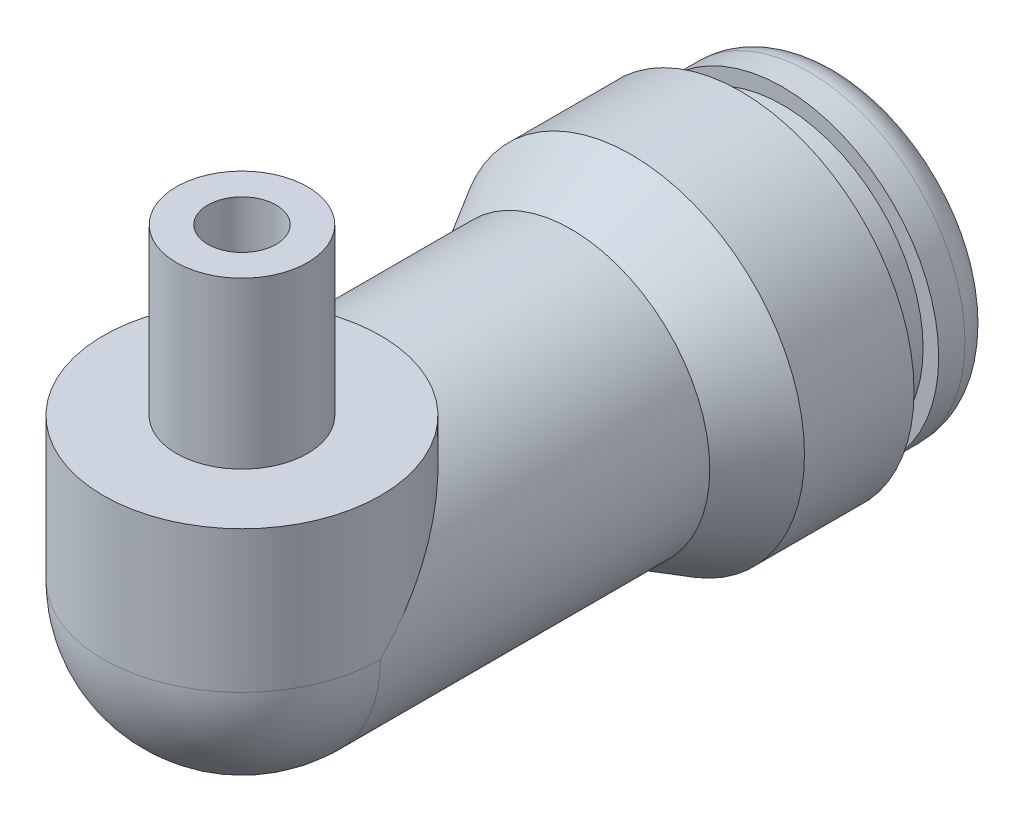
ISO-10303-21;
HEADER;
FILE_DESCRIPTION(('STEP AP214'),'2;1');
FILE_NAME('part.step','',(''),(''),'','','');
FILE_SCHEMA(('AUTOMOTIVE_DESIGN { 1 0 10303 214 1 1 1 1 }'));
ENDSEC;
DATA;
#1=APPLICATION_CONTEXT('core data for automotive mechanical design processes');
#2=APPLICATION_PROTOCOL_DEFINITION('international standard','automotive_design',2000,#1);
#3=PRODUCT_CONTEXT('',#1,'mechanical');
#4=PRODUCT('Part','Part','',(#3));
#5=PRODUCT_RELATED_PRODUCT_CATEGORY('part','',(#4));
#6=PRODUCT_DEFINITION_FORMATION('','',#4);
#7=PRODUCT_DEFINITION_CONTEXT('part definition',#1,'design');
#8=PRODUCT_DEFINITION('design','',#6,#7);
#9=PRODUCT_DEFINITION_SHAPE('','',#8);
#10=(LENGTH_UNIT() NAMED_UNIT(*) SI_UNIT(.MILLI.,.METRE.));
#11=(NAMED_UNIT(*) PLANE_ANGLE_UNIT() SI_UNIT($,.RADIAN.));
#12=(NAMED_UNIT(*) SI_UNIT($,.STERADIAN.) SOLID_ANGLE_UNIT());
#13=UNCERTAINTY_MEASURE_WITH_UNIT(LENGTH_MEASURE(1.E-05),#10,'distance_accuracy_value','');
#14=(GEOMETRIC_REPRESENTATION_CONTEXT(3) GLOBAL_UNCERTAINTY_ASSIGNED_CONTEXT((#13)) GLOBAL_UNIT_ASSIGNED_CONTEXT((#10,
#11,#12)) REPRESENTATION_CONTEXT('',''));
#15=CARTESIAN_POINT('',(0.,0.,0.));
#16=DIRECTION('',(0.,0.,1.));
#17=DIRECTION('',(1.,0.,0.));
#18=AXIS2_PLACEMENT_3D('',#15,#16,#17);
#19=CARTESIAN_POINT('',(0.,3.429,0.));
#20=DIRECTION('',(0.,-1.,0.));
#21=DIRECTION('',(0.,0.,-1.));
#22=AXIS2_PLACEMENT_3D('',#19,#20,#21);
#23=CYLINDRICAL_SURFACE('',#22,0.8255);
#24=CARTESIAN_POINT('',(0.,0.,0.));
#25=DIRECTION('',(0.,-0.707106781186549,-0.707106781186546));
#26=DIRECTION('',(0.,-0.707106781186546,0.707106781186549));
#27=AXIS2_PLACEMENT_3D('',#24,#25,#26);
#28=ELLIPSE('',#27,1.16743329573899,0.8255);
#29=CARTESIAN_POINT('',(0.8255,0.,0.));
#30=VERTEX_POINT('',#29);
#31=CARTESIAN_POINT('',(-0.8255,0.,0.));
#32=VERTEX_POINT('',#31);
#33=EDGE_CURVE('E63',#30,#32,#28,.F.);
#34=ORIENTED_EDGE('',*,*,#33,.F.);
#35=CARTESIAN_POINT('',(0.,0.,0.));
#36=DIRECTION('',(0.,-1.,0.));
#37=DIRECTION('',(1.,0.,0.));
#38=AXIS2_PLACEMENT_3D('',#35,#36,#37);
#39=CIRCLE('',#38,0.8255);
#40=EDGE_CURVE('E67',#30,#32,#39,.T.);
#41=ORIENTED_EDGE('',*,*,#40,.T.);
#42=EDGE_LOOP('',(#34,#41));
#43=FACE_BOUND('',#42,.T.);
#44=CARTESIAN_POINT('',(0.,7.429,0.));
#45=DIRECTION('',(0.,1.,0.));
#46=DIRECTION('',(0.,0.,1.));
#47=AXIS2_PLACEMENT_3D('',#44,#45,#46);
#48=CIRCLE('',#47,0.8255);
#49=CARTESIAN_POINT('',(0.,7.429,0.825499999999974));
#50=VERTEX_POINT('',#49);
#51=EDGE_CURVE('E355',#50,#50,#48,.F.);
#52=ORIENTED_EDGE('',*,*,#51,.F.);
#53=EDGE_LOOP('',(#52));
#54=FACE_BOUND('',#53,.T.);
#55=ADVANCED_FACE('F35',(#43,#54),#23,.F.);
#56=CARTESIAN_POINT('',(0.,23.6671280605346,0.));
#57=DIRECTION('',(0.,-1.,0.));
#58=DIRECTION('',(0.,0.,-1.));
#59=AXIS2_PLACEMENT_3D('',#56,#57,#58);
#60=CYLINDRICAL_SURFACE('',#59,1.5875);
#61=CARTESIAN_POINT('',(0.,3.429,0.));
#62=DIRECTION('',(0.,1.,0.));
#63=DIRECTION('',(0.,0.,1.));
#64=AXIS2_PLACEMENT_3D('',#61,#62,#63);
#65=CIRCLE('',#64,1.5875);
#66=CARTESIAN_POINT('',(0.,3.42900000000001,1.58749999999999));
#67=VERTEX_POINT('',#66);
#68=EDGE_CURVE('E70',#67,#67,#65,.T.);
#69=ORIENTED_EDGE('',*,*,#68,.T.);
#70=EDGE_LOOP('',(#69));
#71=FACE_BOUND('',#70,.T.);
#72=CARTESIAN_POINT('',(0.,7.429,0.));
#73=DIRECTION('',(0.,1.,0.));
#74=DIRECTION('',(0.,0.,1.));
#75=AXIS2_PLACEMENT_3D('',#72,#73,#74);
#76=CIRCLE('',#75,1.5875);
#77=CARTESIAN_POINT('',(0.,7.42900000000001,1.58749999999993));
#78=VERTEX_POINT('',#77);
#79=EDGE_CURVE('E358',#78,#78,#76,.F.);
#80=ORIENTED_EDGE('',*,*,#79,.T.);
#81=EDGE_LOOP('',(#80));
#82=FACE_BOUND('',#81,.T.);
#83=ADVANCED_FACE('F206',(#71,#82),#60,.T.);
#84=CARTESIAN_POINT('',(0.,3.429,0.));
#85=DIRECTION('',(0.,1.,0.));
#86=DIRECTION('',(0.,0.,1.));
#87=AXIS2_PLACEMENT_3D('',#84,#85,#86);
#88=PLANE('',#87);
#89=CARTESIAN_POINT('',(0.,3.429,0.));
#90=DIRECTION('',(0.,1.,0.));
#91=DIRECTION('',(0.,0.,1.));
#92=AXIS2_PLACEMENT_3D('',#89,#90,#91);
#93=CIRCLE('',#92,3.3528);
#94=CARTESIAN_POINT('',(0.,3.42900000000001,3.35279999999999));
#95=VERTEX_POINT('',#94);
#96=EDGE_CURVE('E91',#95,#95,#93,.T.);
#97=ORIENTED_EDGE('',*,*,#96,.T.);
#98=EDGE_LOOP('',(#97));
#99=FACE_BOUND('',#98,.T.);
#100=ORIENTED_EDGE('',*,*,#68,.F.);
#101=EDGE_LOOP('',(#100));
#102=FACE_BOUND('',#101,.T.);
#103=ADVANCED_FACE('F190',(#99,#102),#88,.T.);
#104=CARTESIAN_POINT('',(0.,0.,0.));
#105=DIRECTION('',(0.,0.,1.));
#106=DIRECTION('',(1.,0.,0.));
#107=AXIS2_PLACEMENT_3D('',#104,#105,#106);
#108=CYLINDRICAL_SURFACE('',#107,1.5875);
#109=CARTESIAN_POINT('',(0.,0.,-14.097));
#110=DIRECTION('',(0.,0.,1.));
#111=DIRECTION('',(1.,0.,0.));
#112=AXIS2_PLACEMENT_3D('',#109,#110,#111);
#113=CIRCLE('',#112,1.5875);
#114=CARTESIAN_POINT('',(1.5875,0.,-14.097));
#115=VERTEX_POINT('',#114);
#116=EDGE_CURVE('E82',#115,#115,#113,.T.);
#117=ORIENTED_EDGE('',*,*,#116,.F.);
#118=EDGE_LOOP('',(#117));
#119=FACE_BOUND('',#118,.T.);
#120=CARTESIAN_POINT('',(0.,0.,-3.3528));
#121=DIRECTION('',(0.,0.,1.));
#122=DIRECTION('',(1.,0.,0.));
#123=AXIS2_PLACEMENT_3D('',#120,#121,#122);
#124=CIRCLE('',#123,1.5875);
#125=CARTESIAN_POINT('',(1.5875,0.,-3.3528));
#126=VERTEX_POINT('',#125);
#127=EDGE_CURVE('E13',#126,#126,#124,.F.);
#128=ORIENTED_EDGE('',*,*,#127,.F.);
#129=EDGE_LOOP('',(#128));
#130=FACE_BOUND('',#129,.T.);
#131=ADVANCED_FACE('F37',(#119,#130),#108,.F.);
#132=CARTESIAN_POINT('',(0.,0.,0.));
#133=DIRECTION('',(0.,0.,1.));
#134=DIRECTION('',(1.,0.,0.));
#135=AXIS2_PLACEMENT_3D('',#132,#133,#134);
#136=CYLINDRICAL_SURFACE('',#135,3.3528);
#137=CARTESIAN_POINT('',(0.,0.,0.));
#138=DIRECTION('',(0.,0.,1.));
#139=DIRECTION('',(1.,0.,0.));
#140=AXIS2_PLACEMENT_3D('',#137,#138,#139);
#141=CIRCLE('',#140,3.3528);
#142=CARTESIAN_POINT('',(-3.3528,0.,0.));
#143=VERTEX_POINT('',#142);
#144=CARTESIAN_POINT('',(3.3528,0.,0.));
#145=VERTEX_POINT('',#144);
#146=EDGE_CURVE('E51',#143,#145,#141,.T.);
#147=ORIENTED_EDGE('',*,*,#146,.F.);
#148=CARTESIAN_POINT('',(0.,0.,0.));
#149=DIRECTION('',(0.,0.707106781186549,0.707106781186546));
#150=DIRECTION('',(0.,-0.707106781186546,0.707106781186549));
#151=AXIS2_PLACEMENT_3D('',#148,#149,#150);
#152=ELLIPSE('',#151,4.74157523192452,3.3528);
#153=EDGE_CURVE('E55',#143,#145,#152,.F.);
#154=ORIENTED_EDGE('',*,*,#153,.T.);
#155=EDGE_LOOP('',(#147,#154));
#156=FACE_BOUND('',#155,.T.);
#157=CARTESIAN_POINT('',(0.,0.,-7.9629));
#158=DIRECTION('',(0.,0.,1.));
#159=DIRECTION('',(1.,0.,0.));
#160=AXIS2_PLACEMENT_3D('',#157,#158,#159);
#161=CIRCLE('',#160,3.3528);
#162=CARTESIAN_POINT('',(3.3528,0.,-7.9629));
#163=VERTEX_POINT('',#162);
#164=EDGE_CURVE('E44',#163,#163,#161,.T.);
#165=ORIENTED_EDGE('',*,*,#164,.T.);
#166=EDGE_LOOP('',(#165));
#167=FACE_BOUND('',#166,.T.);
#168=ADVANCED_FACE('F131',(#156,#167),#136,.T.);
#169=CARTESIAN_POINT('',(0.,0.,-9.41470498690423));
#170=DIRECTION('',(0.,0.,-1.));
#171=DIRECTION('',(-1.,0.,0.));
#172=AXIS2_PLACEMENT_3D('',#169,#170,#171);
#173=CONICAL_SURFACE('',#172,4.191,0.5235987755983);
#174=ORIENTED_EDGE('',*,*,#164,.F.);
#175=EDGE_LOOP('',(#174));
#176=FACE_BOUND('',#175,.T.);
#177=CARTESIAN_POINT('',(0.,0.,-9.41470498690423));
#178=DIRECTION('',(0.,0.,1.));
#179=DIRECTION('',(1.,0.,0.));
#180=AXIS2_PLACEMENT_3D('',#177,#178,#179);
#181=CIRCLE('',#180,4.191);
#182=CARTESIAN_POINT('',(4.191,0.,-9.41470498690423));
#183=VERTEX_POINT('',#182);
#184=EDGE_CURVE('E125',#183,#183,#181,.T.);
#185=ORIENTED_EDGE('',*,*,#184,.T.);
#186=EDGE_LOOP('',(#185));
#187=FACE_BOUND('',#186,.T.);
#188=ADVANCED_FACE('F133',(#176,#187),#173,.T.);
#189=CARTESIAN_POINT('',(0.,0.,0.));
#190=DIRECTION('',(0.,0.,1.));
#191=DIRECTION('',(1.,0.,0.));
#192=AXIS2_PLACEMENT_3D('',#189,#190,#191);
#193=CYLINDRICAL_SURFACE('',#192,4.191);
#194=ORIENTED_EDGE('',*,*,#184,.F.);
#195=EDGE_LOOP('',(#194));
#196=FACE_BOUND('',#195,.T.);
#197=CARTESIAN_POINT('',(0.,0.,-12.065));
#198=DIRECTION('',(0.,0.,1.));
#199=DIRECTION('',(1.,0.,0.));
#200=AXIS2_PLACEMENT_3D('',#197,#198,#199);
#201=CIRCLE('',#200,4.191);
#202=CARTESIAN_POINT('',(4.191,0.,-12.065));
#203=VERTEX_POINT('',#202);
#204=EDGE_CURVE('E122',#203,#203,#201,.T.);
#205=ORIENTED_EDGE('',*,*,#204,.T.);
#206=EDGE_LOOP('',(#205));
#207=FACE_BOUND('',#206,.T.);
#208=ADVANCED_FACE('F136',(#196,#207),#193,.T.);
#209=CARTESIAN_POINT('',(0.,4.191,-12.065));
#210=DIRECTION('',(0.,0.,1.));
#211=DIRECTION('',(1.,0.,0.));
#212=AXIS2_PLACEMENT_3D('',#209,#210,#211);
#213=PLANE('',#212);
#214=ORIENTED_EDGE('',*,*,#204,.F.);
#215=EDGE_LOOP('',(#214));
#216=FACE_BOUND('',#215,.T.);
#217=CARTESIAN_POINT('',(0.,0.,-12.065));
#218=DIRECTION('',(0.,0.,1.));
#219=DIRECTION('',(1.,0.,0.));
#220=AXIS2_PLACEMENT_3D('',#217,#218,#219);
#221=CIRCLE('',#220,3.39471);
#222=CARTESIAN_POINT('',(3.39471,0.,-12.065));
#223=VERTEX_POINT('',#222);
#224=EDGE_CURVE('E119',#223,#223,#221,.T.);
#225=ORIENTED_EDGE('',*,*,#224,.T.);
#226=EDGE_LOOP('',(#225));
#227=FACE_BOUND('',#226,.T.);
#228=ADVANCED_FACE('F142',(#216,#227),#213,.F.);
#229=CARTESIAN_POINT('',(0.,0.,0.));
#230=DIRECTION('',(0.,0.,1.));
#231=DIRECTION('',(1.,0.,0.));
#232=AXIS2_PLACEMENT_3D('',#229,#230,#231);
#233=CYLINDRICAL_SURFACE('',#232,3.39471);
#234=ORIENTED_EDGE('',*,*,#224,.F.);
#235=EDGE_LOOP('',(#234));
#236=FACE_BOUND('',#235,.T.);
#237=CARTESIAN_POINT('',(0.,0.,-13.081));
#238=DIRECTION('',(0.,0.,1.));
#239=DIRECTION('',(1.,0.,0.));
#240=AXIS2_PLACEMENT_3D('',#237,#238,#239);
#241=CIRCLE('',#240,3.39471);
#242=CARTESIAN_POINT('',(3.39471,0.,-13.081));
#243=VERTEX_POINT('',#242);
#244=EDGE_CURVE('E116',#243,#243,#241,.T.);
#245=ORIENTED_EDGE('',*,*,#244,.T.);
#246=EDGE_LOOP('',(#245));
#247=FACE_BOUND('',#246,.T.);
#248=ADVANCED_FACE('F148',(#236,#247),#233,.T.);
#249=CARTESIAN_POINT('',(0.,3.7719,-13.081));
#250=DIRECTION('',(0.,0.,-1.));
#251=DIRECTION('',(-1.,0.,0.));
#252=AXIS2_PLACEMENT_3D('',#249,#250,#251);
#253=PLANE('',#252);
#254=ORIENTED_EDGE('',*,*,#244,.F.);
#255=EDGE_LOOP('',(#254));
#256=FACE_BOUND('',#255,.T.);
#257=CARTESIAN_POINT('',(0.,0.,-13.081));
#258=DIRECTION('',(0.,0.,1.));
#259=DIRECTION('',(1.,0.,0.));
#260=AXIS2_PLACEMENT_3D('',#257,#258,#259);
#261=CIRCLE('',#260,3.7719);
#262=CARTESIAN_POINT('',(3.7719,0.,-13.081));
#263=VERTEX_POINT('',#262);
#264=EDGE_CURVE('E113',#263,#263,#261,.T.);
#265=ORIENTED_EDGE('',*,*,#264,.T.);
#266=EDGE_LOOP('',(#265));
#267=FACE_BOUND('',#266,.T.);
#268=ADVANCED_FACE('F154',(#256,#267),#253,.F.);
#269=CARTESIAN_POINT('',(0.,0.,0.));
#270=DIRECTION('',(0.,0.,1.));
#271=DIRECTION('',(1.,0.,0.));
#272=AXIS2_PLACEMENT_3D('',#269,#270,#271);
#273=CYLINDRICAL_SURFACE('',#272,3.7719);
#274=ORIENTED_EDGE('',*,*,#264,.F.);
#275=EDGE_LOOP('',(#274));
#276=FACE_BOUND('',#275,.T.);
#277=CARTESIAN_POINT('',(0.,0.,-13.716));
#278=DIRECTION('',(0.,0.,1.));
#279=DIRECTION('',(1.,0.,0.));
#280=AXIS2_PLACEMENT_3D('',#277,#278,#279);
#281=CIRCLE('',#280,3.7719);
#282=CARTESIAN_POINT('',(3.7719,0.,-13.716));
#283=VERTEX_POINT('',#282);
#284=EDGE_CURVE('E110',#283,#283,#281,.T.);
#285=ORIENTED_EDGE('',*,*,#284,.T.);
#286=EDGE_LOOP('',(#285));
#287=FACE_BOUND('',#286,.T.);
#288=ADVANCED_FACE('F160',(#276,#287),#273,.T.);
#289=CARTESIAN_POINT('',(0.,0.,-13.716));
#290=DIRECTION('',(0.,0.,1.));
#291=DIRECTION('',(1.,0.,0.));
#292=AXIS2_PLACEMENT_3D('',#289,#290,#291);
#293=TOROIDAL_SURFACE('',#292,3.0099,0.762);
#294=ORIENTED_EDGE('',*,*,#284,.F.);
#295=EDGE_LOOP('',(#294));
#296=FACE_BOUND('',#295,.T.);
#297=CARTESIAN_POINT('',(0.,0.,-14.478));
#298=DIRECTION('',(0.,0.,1.));
#299=DIRECTION('',(1.,0.,0.));
#300=AXIS2_PLACEMENT_3D('',#297,#298,#299);
#301=CIRCLE('',#300,3.0099);
#302=CARTESIAN_POINT('',(3.0099,0.,-14.478));
#303=VERTEX_POINT('',#302);
#304=EDGE_CURVE('E107',#303,#303,#301,.T.);
#305=ORIENTED_EDGE('',*,*,#304,.T.);
#306=EDGE_LOOP('',(#305));
#307=FACE_BOUND('',#306,.T.);
#308=ADVANCED_FACE('F166',(#296,#307),#293,.T.);
#309=CARTESIAN_POINT('',(0.,3.0099,-14.478));
#310=DIRECTION('',(0.,0.,1.));
#311=DIRECTION('',(1.,0.,0.));
#312=AXIS2_PLACEMENT_3D('',#309,#310,#311);
#313=PLANE('',#312);
#314=ORIENTED_EDGE('',*,*,#304,.F.);
#315=EDGE_LOOP('',(#314));
#316=FACE_BOUND('',#315,.T.);
#317=CARTESIAN_POINT('',(0.,0.,-14.478));
#318=DIRECTION('',(0.,0.,1.));
#319=DIRECTION('',(1.,0.,0.));
#320=AXIS2_PLACEMENT_3D('',#317,#318,#319);
#321=CIRCLE('',#320,1.9685);
#322=CARTESIAN_POINT('',(1.9685,0.,-14.478));
#323=VERTEX_POINT('',#322);
#324=EDGE_CURVE('E104',#323,#323,#321,.T.);
#325=ORIENTED_EDGE('',*,*,#324,.T.);
#326=EDGE_LOOP('',(#325));
#327=FACE_BOUND('',#326,.T.);
#328=ADVANCED_FACE('F172',(#316,#327),#313,.F.);
#329=CARTESIAN_POINT('',(0.,0.,-14.097));
#330=DIRECTION('',(0.,0.,-1.));
#331=DIRECTION('',(-1.,0.,0.));
#332=AXIS2_PLACEMENT_3D('',#329,#330,#331);
#333=CONICAL_SURFACE('',#332,1.5875,0.785398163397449);
#334=ORIENTED_EDGE('',*,*,#324,.F.);
#335=EDGE_LOOP('',(#334));
#336=FACE_BOUND('',#335,.T.);
#337=ORIENTED_EDGE('',*,*,#116,.T.);
#338=EDGE_LOOP('',(#337));
#339=FACE_BOUND('',#338,.T.);
#340=ADVANCED_FACE('F178',(#336,#339),#333,.F.);
#341=CARTESIAN_POINT('',(0.,0.,-3.3528));
#342=DIRECTION('',(0.,0.,1.));
#343=DIRECTION('',(1.,0.,0.));
#344=AXIS2_PLACEMENT_3D('',#341,#342,#343);
#345=PLANE('',#344);
#346=ORIENTED_EDGE('',*,*,#127,.T.);
#347=EDGE_LOOP('',(#346));
#348=FACE_BOUND('',#347,.T.);
#349=CARTESIAN_POINT('',(0.,0.,-3.3528));
#350=DIRECTION('',(0.,0.,1.));
#351=DIRECTION('',(1.,0.,0.));
#352=AXIS2_PLACEMENT_3D('',#349,#350,#351);
#353=CIRCLE('',#352,0.8255);
#354=CARTESIAN_POINT('',(0.8255,0.,-3.3528));
#355=VERTEX_POINT('',#354);
#356=EDGE_CURVE('E79',#355,#355,#353,.T.);
#357=ORIENTED_EDGE('',*,*,#356,.T.);
#358=EDGE_LOOP('',(#357));
#359=FACE_BOUND('',#358,.T.);
#360=ADVANCED_FACE('F184',(#348,#359),#345,.F.);
#361=CARTESIAN_POINT('',(0.,0.,-3.3528));
#362=DIRECTION('',(0.,0.,1.));
#363=DIRECTION('',(1.,0.,0.));
#364=AXIS2_PLACEMENT_3D('',#361,#362,#363);
#365=CYLINDRICAL_SURFACE('',#364,0.8255);
#366=CARTESIAN_POINT('',(0.,0.,0.));
#367=DIRECTION('',(0.,0.,-1.));
#368=DIRECTION('',(1.,0.,0.));
#369=AXIS2_PLACEMENT_3D('',#366,#367,#368);
#370=CIRCLE('',#369,0.8255);
#371=EDGE_CURVE('E72',#30,#32,#370,.T.);
#372=ORIENTED_EDGE('',*,*,#371,.F.);
#373=ORIENTED_EDGE('',*,*,#33,.T.);
#374=EDGE_LOOP('',(#372,#373));
#375=FACE_BOUND('',#374,.T.);
#376=ORIENTED_EDGE('',*,*,#356,.F.);
#377=EDGE_LOOP('',(#376));
#378=FACE_BOUND('',#377,.T.);
#379=ADVANCED_FACE('F73',(#375,#378),#365,.F.);
#380=CARTESIAN_POINT('',(0.,0.,0.));
#381=DIRECTION('',(1.,0.,0.));
#382=DIRECTION('',(0.,0.,-1.));
#383=AXIS2_PLACEMENT_3D('',#380,#381,#382);
#384=SPHERICAL_SURFACE('',#383,3.3528);
#385=ORIENTED_EDGE('',*,*,#146,.T.);
#386=CARTESIAN_POINT('',(0.,0.,0.));
#387=DIRECTION('',(0.,1.,0.));
#388=DIRECTION('',(1.,0.,0.));
#389=AXIS2_PLACEMENT_3D('',#386,#387,#388);
#390=CIRCLE('',#389,3.3528);
#391=EDGE_CURVE('E76',#143,#145,#390,.T.);
#392=ORIENTED_EDGE('',*,*,#391,.F.);
#393=EDGE_LOOP('',(#385,#392));
#394=FACE_BOUND('',#393,.T.);
#395=ADVANCED_FACE('F198',(#394),#384,.T.);
#396=CARTESIAN_POINT('',(0.,0.,0.));
#397=DIRECTION('',(1.,0.,0.));
#398=DIRECTION('',(0.,0.,1.));
#399=AXIS2_PLACEMENT_3D('',#396,#397,#398);
#400=SPHERICAL_SURFACE('',#399,0.8255);
#401=ORIENTED_EDGE('',*,*,#371,.T.);
#402=ORIENTED_EDGE('',*,*,#40,.F.);
#403=EDGE_LOOP('',(#401,#402));
#404=FACE_BOUND('',#403,.T.);
#405=ADVANCED_FACE('F78',(#404),#400,.F.);
#406=CARTESIAN_POINT('',(0.,3.429,0.));
#407=DIRECTION('',(0.,-1.,0.));
#408=DIRECTION('',(0.,0.,-1.));
#409=AXIS2_PLACEMENT_3D('',#406,#407,#408);
#410=CYLINDRICAL_SURFACE('',#409,3.3528);
#411=ORIENTED_EDGE('',*,*,#391,.T.);
#412=ORIENTED_EDGE('',*,*,#153,.F.);
#413=EDGE_LOOP('',(#411,#412));
#414=FACE_BOUND('',#413,.T.);
#415=ORIENTED_EDGE('',*,*,#96,.F.);
#416=EDGE_LOOP('',(#415));
#417=FACE_BOUND('',#416,.T.);
#418=ADVANCED_FACE('F215',(#414,#417),#410,.T.);
#419=CARTESIAN_POINT('',(0.,7.429,0.));
#420=DIRECTION('',(0.,1.,0.));
#421=DIRECTION('',(0.,0.,1.));
#422=AXIS2_PLACEMENT_3D('',#419,#420,#421);
#423=PLANE('',#422);
#424=ORIENTED_EDGE('',*,*,#79,.F.);
#425=EDGE_LOOP('',(#424));
#426=FACE_BOUND('',#425,.T.);
#427=ORIENTED_EDGE('',*,*,#51,.T.);
#428=EDGE_LOOP('',(#427));
#429=FACE_BOUND('',#428,.T.);
#430=ADVANCED_FACE('F217',(#426,#429),#423,.T.);
#431=CLOSED_SHELL('',(#55,#83,#103,#131,#168,#188,#208,#228,#248,#268,#288,#308,#328,#340,#360,
#379,#395,#405,#418,#430));
#432=MANIFOLD_SOLID_BREP('B2',#431);
#433=ADVANCED_BREP_SHAPE_REPRESENTATION('',(#18,#432),#14);
#434=SHAPE_DEFINITION_REPRESENTATION(#9,#433);
ENDSEC;
END-ISO-10303-21;
